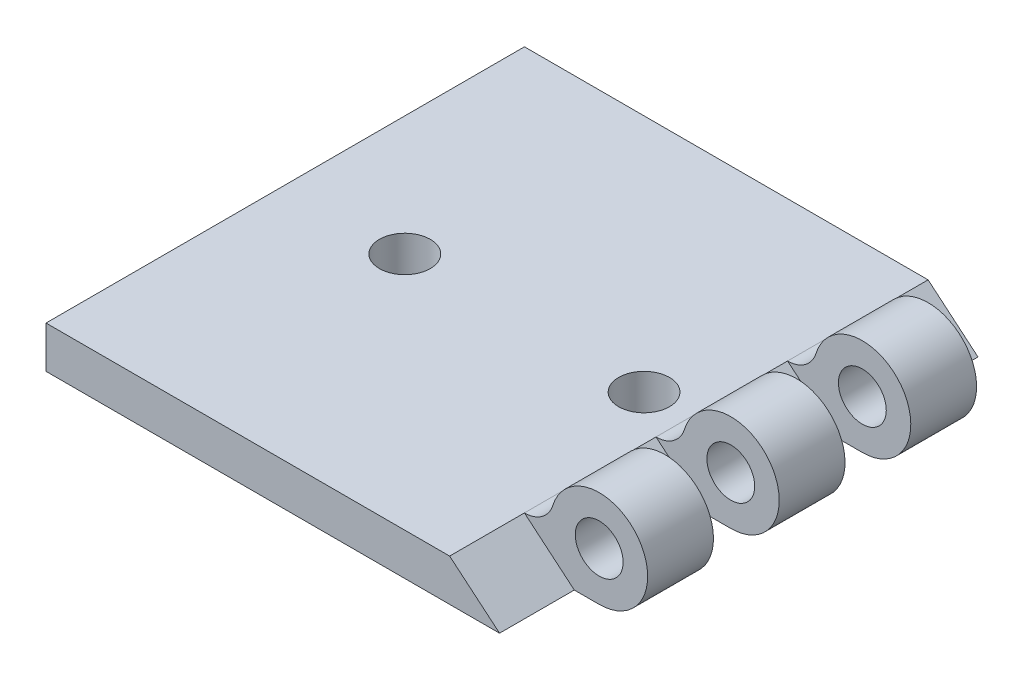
ISO-10303-21;
HEADER;
FILE_DESCRIPTION(('STEP AP214'),'2;1');
FILE_NAME('part.step','',(''),(''),'','','');
FILE_SCHEMA(('AUTOMOTIVE_DESIGN { 1 0 10303 214 1 1 1 1 }'));
ENDSEC;
DATA;
#1=APPLICATION_CONTEXT('core data for automotive mechanical design processes');
#2=APPLICATION_PROTOCOL_DEFINITION('international standard','automotive_design',2000,#1);
#3=PRODUCT_CONTEXT('',#1,'mechanical');
#4=PRODUCT('Part','Part','',(#3));
#5=PRODUCT_RELATED_PRODUCT_CATEGORY('part','',(#4));
#6=PRODUCT_DEFINITION_FORMATION('','',#4);
#7=PRODUCT_DEFINITION_CONTEXT('part definition',#1,'design');
#8=PRODUCT_DEFINITION('design','',#6,#7);
#9=PRODUCT_DEFINITION_SHAPE('','',#8);
#10=(LENGTH_UNIT() NAMED_UNIT(*) SI_UNIT(.MILLI.,.METRE.));
#11=(NAMED_UNIT(*) PLANE_ANGLE_UNIT() SI_UNIT($,.RADIAN.));
#12=(NAMED_UNIT(*) SI_UNIT($,.STERADIAN.) SOLID_ANGLE_UNIT());
#13=UNCERTAINTY_MEASURE_WITH_UNIT(LENGTH_MEASURE(1.E-05),#10,'distance_accuracy_value','');
#14=(GEOMETRIC_REPRESENTATION_CONTEXT(3) GLOBAL_UNCERTAINTY_ASSIGNED_CONTEXT((#13)) GLOBAL_UNIT_ASSIGNED_CONTEXT((#10,
#11,#12)) REPRESENTATION_CONTEXT('',''));
#15=CARTESIAN_POINT('',(0.,0.,0.));
#16=DIRECTION('',(0.,0.,1.));
#17=DIRECTION('',(1.,0.,0.));
#18=AXIS2_PLACEMENT_3D('',#15,#16,#17);
#19=CARTESIAN_POINT('',(-12.5059985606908,12.,80.));
#20=DIRECTION('',(0.,0.,-1.));
#21=DIRECTION('',(-1.,0.,0.));
#22=AXIS2_PLACEMENT_3D('',#19,#20,#21);
#23=CYLINDRICAL_SURFACE('',#22,5.);
#24=CARTESIAN_POINT('',(-12.5059985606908,12.,12.5));
#25=DIRECTION('',(0.,0.,-1.));
#26=DIRECTION('',(0.,1.,0.));
#27=AXIS2_PLACEMENT_3D('',#24,#25,#26);
#28=CIRCLE('',#27,5.);
#29=CARTESIAN_POINT('',(-12.5059985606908,6.99999999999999,12.5));
#30=VERTEX_POINT('',#29);
#31=CARTESIAN_POINT('',(-7.73271666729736,10.5114503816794,12.5));
#32=VERTEX_POINT('',#31);
#33=EDGE_CURVE('E153',#30,#32,#28,.F.);
#34=ORIENTED_EDGE('',*,*,#33,.F.);
#35=DIRECTION('',(0.,0.,-1.));
#36=VECTOR('',#35,1.);
#37=CARTESIAN_POINT('',(-12.5059985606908,6.99999999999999,80.));
#38=LINE('',#37,#36);
#39=CARTESIAN_POINT('',(-12.5059985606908,6.99999999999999,23.5));
#40=VERTEX_POINT('',#39);
#41=EDGE_CURVE('E174',#40,#30,#38,.T.);
#42=ORIENTED_EDGE('',*,*,#41,.F.);
#43=CARTESIAN_POINT('',(-12.5059985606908,12.,23.5));
#44=DIRECTION('',(0.,0.,1.));
#45=DIRECTION('',(0.,-1.,0.));
#46=AXIS2_PLACEMENT_3D('',#43,#44,#45);
#47=CIRCLE('',#46,5.);
#48=CARTESIAN_POINT('',(-7.73271666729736,10.5114503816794,23.5));
#49=VERTEX_POINT('',#48);
#50=EDGE_CURVE('E276',#49,#40,#47,.F.);
#51=ORIENTED_EDGE('',*,*,#50,.F.);
#52=DIRECTION('',(0.,0.,-1.));
#53=VECTOR('',#52,1.);
#54=CARTESIAN_POINT('',(-7.73271666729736,10.5114503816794,80.));
#55=LINE('',#54,#53);
#56=EDGE_CURVE('E177',#49,#32,#55,.T.);
#57=ORIENTED_EDGE('',*,*,#56,.T.);
#58=EDGE_LOOP('',(#34,#42,#51,#57));
#59=FACE_BOUND('',#58,.T.);
#60=ADVANCED_FACE('F34',(#59),#23,.F.);
#61=CARTESIAN_POINT('',(0.,0.,80.));
#62=DIRECTION('',(0.,1.,0.));
#63=DIRECTION('',(-1.,0.,0.));
#64=AXIS2_PLACEMENT_3D('',#61,#62,#63);
#65=PLANE('',#64);
#66=CARTESIAN_POINT('',(-20.,0.,40.));
#67=DIRECTION('',(0.,-1.,0.));
#68=DIRECTION('',(1.,0.,0.));
#69=AXIS2_PLACEMENT_3D('',#66,#67,#68);
#70=CIRCLE('',#69,4.25);
#71=CARTESIAN_POINT('',(-15.75,0.,40.));
#72=VERTEX_POINT('',#71);
#73=EDGE_CURVE('E319',#72,#72,#70,.T.);
#74=ORIENTED_EDGE('',*,*,#73,.F.);
#75=EDGE_LOOP('',(#74));
#76=FACE_BOUND('',#75,.T.);
#77=CARTESIAN_POINT('',(-60.,0.,40.));
#78=DIRECTION('',(0.,-1.,0.));
#79=DIRECTION('',(1.,0.,0.));
#80=AXIS2_PLACEMENT_3D('',#77,#78,#79);
#81=CIRCLE('',#80,4.25000000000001);
#82=CARTESIAN_POINT('',(-55.75,0.,40.));
#83=VERTEX_POINT('',#82);
#84=EDGE_CURVE('E311',#83,#83,#81,.T.);
#85=ORIENTED_EDGE('',*,*,#84,.F.);
#86=EDGE_LOOP('',(#85));
#87=FACE_BOUND('',#86,.T.);
#88=DIRECTION('',(0.,0.,-1.));
#89=VECTOR('',#88,1.);
#90=CARTESIAN_POINT('',(-4.16372341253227,0.,80.));
#91=LINE('',#90,#89);
#92=CARTESIAN_POINT('',(-4.16372341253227,0.,12.5));
#93=VERTEX_POINT('',#92);
#94=CARTESIAN_POINT('',(-4.16372341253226,0.,0.));
#95=VERTEX_POINT('',#94);
#96=EDGE_CURVE('E257',#93,#95,#91,.T.);
#97=ORIENTED_EDGE('',*,*,#96,.F.);
#98=DIRECTION('',(-1.,0.,0.));
#99=VECTOR('',#98,1.);
#100=CARTESIAN_POINT('',(0.,0.,12.5));
#101=LINE('',#100,#99);
#102=CARTESIAN_POINT('',(0.,0.,12.5));
#103=VERTEX_POINT('',#102);
#104=EDGE_CURVE('E156',#103,#93,#101,.T.);
#105=ORIENTED_EDGE('',*,*,#104,.F.);
#106=DIRECTION('',(0.,0.,-1.));
#107=VECTOR('',#106,1.);
#108=CARTESIAN_POINT('',(0.,0.,80.));
#109=LINE('',#108,#107);
#110=CARTESIAN_POINT('',(0.,0.,23.5));
#111=VERTEX_POINT('',#110);
#112=EDGE_CURVE('E239',#111,#103,#109,.T.);
#113=ORIENTED_EDGE('',*,*,#112,.F.);
#114=DIRECTION('',(1.,0.,0.));
#115=VECTOR('',#114,1.);
#116=CARTESIAN_POINT('',(0.,0.,23.5));
#117=LINE('',#116,#115);
#118=CARTESIAN_POINT('',(-4.16372341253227,0.,23.5));
#119=VERTEX_POINT('',#118);
#120=EDGE_CURVE('E274',#119,#111,#117,.T.);
#121=ORIENTED_EDGE('',*,*,#120,.F.);
#122=DIRECTION('',(0.,0.,-1.));
#123=VECTOR('',#122,1.);
#124=CARTESIAN_POINT('',(-4.16372341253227,0.,80.));
#125=LINE('',#124,#123);
#126=CARTESIAN_POINT('',(-4.16372341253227,0.,34.5));
#127=VERTEX_POINT('',#126);
#128=EDGE_CURVE('E269',#127,#119,#125,.T.);
#129=ORIENTED_EDGE('',*,*,#128,.F.);
#130=DIRECTION('',(-1.,0.,0.));
#131=VECTOR('',#130,1.);
#132=CARTESIAN_POINT('',(0.,0.,34.5));
#133=LINE('',#132,#131);
#134=CARTESIAN_POINT('',(0.,0.,34.5));
#135=VERTEX_POINT('',#134);
#136=EDGE_CURVE('E281',#135,#127,#133,.T.);
#137=ORIENTED_EDGE('',*,*,#136,.F.);
#138=CARTESIAN_POINT('',(0.,0.,45.5));
#139=VERTEX_POINT('',#138);
#140=EDGE_CURVE('E244',#139,#135,#109,.T.);
#141=ORIENTED_EDGE('',*,*,#140,.F.);
#142=DIRECTION('',(1.,0.,0.));
#143=VECTOR('',#142,1.);
#144=CARTESIAN_POINT('',(0.,0.,45.5));
#145=LINE('',#144,#143);
#146=CARTESIAN_POINT('',(-4.16372341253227,0.,45.5));
#147=VERTEX_POINT('',#146);
#148=EDGE_CURVE('E294',#147,#139,#145,.T.);
#149=ORIENTED_EDGE('',*,*,#148,.F.);
#150=DIRECTION('',(0.,0.,-1.));
#151=VECTOR('',#150,1.);
#152=CARTESIAN_POINT('',(-4.16372341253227,0.,80.));
#153=LINE('',#152,#151);
#154=CARTESIAN_POINT('',(-4.16372341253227,0.,56.5));
#155=VERTEX_POINT('',#154);
#156=EDGE_CURVE('E289',#155,#147,#153,.T.);
#157=ORIENTED_EDGE('',*,*,#156,.F.);
#158=DIRECTION('',(-1.,0.,0.));
#159=VECTOR('',#158,1.);
#160=CARTESIAN_POINT('',(0.,0.,56.5));
#161=LINE('',#160,#159);
#162=CARTESIAN_POINT('',(0.,0.,56.5));
#163=VERTEX_POINT('',#162);
#164=EDGE_CURVE('E207',#163,#155,#161,.T.);
#165=ORIENTED_EDGE('',*,*,#164,.F.);
#166=CARTESIAN_POINT('',(0.,0.,67.5));
#167=VERTEX_POINT('',#166);
#168=EDGE_CURVE('E241',#167,#163,#109,.T.);
#169=ORIENTED_EDGE('',*,*,#168,.F.);
#170=DIRECTION('',(1.,0.,0.));
#171=VECTOR('',#170,1.);
#172=CARTESIAN_POINT('',(0.,0.,67.5));
#173=LINE('',#172,#171);
#174=CARTESIAN_POINT('',(-4.16372341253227,0.,67.5));
#175=VERTEX_POINT('',#174);
#176=EDGE_CURVE('E221',#175,#167,#173,.T.);
#177=ORIENTED_EDGE('',*,*,#176,.F.);
#178=DIRECTION('',(0.,0.,-1.));
#179=VECTOR('',#178,1.);
#180=CARTESIAN_POINT('',(-4.16372341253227,0.,80.));
#181=LINE('',#180,#179);
#182=CARTESIAN_POINT('',(-4.16372341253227,0.,80.));
#183=VERTEX_POINT('',#182);
#184=EDGE_CURVE('E11',#183,#175,#181,.T.);
#185=ORIENTED_EDGE('',*,*,#184,.F.);
#186=DIRECTION('',(1.,0.,0.));
#187=VECTOR('',#186,1.);
#188=CARTESIAN_POINT('',(0.,0.,80.));
#189=LINE('',#188,#187);
#190=CARTESIAN_POINT('',(-80.,0.,80.));
#191=VERTEX_POINT('',#190);
#192=EDGE_CURVE('E230',#191,#183,#189,.T.);
#193=ORIENTED_EDGE('',*,*,#192,.F.);
#194=DIRECTION('',(0.,0.,-1.));
#195=VECTOR('',#194,1.);
#196=CARTESIAN_POINT('',(-80.,0.,80.));
#197=LINE('',#196,#195);
#198=CARTESIAN_POINT('',(-80.,0.,0.));
#199=VERTEX_POINT('',#198);
#200=EDGE_CURVE('E187',#191,#199,#197,.T.);
#201=ORIENTED_EDGE('',*,*,#200,.T.);
#202=DIRECTION('',(1.,0.,0.));
#203=VECTOR('',#202,1.);
#204=CARTESIAN_POINT('',(0.,0.,0.));
#205=LINE('',#204,#203);
#206=EDGE_CURVE('E228',#199,#95,#205,.T.);
#207=ORIENTED_EDGE('',*,*,#206,.T.);
#208=EDGE_LOOP('',(#97,#105,#113,#121,#129,#137,#141,#149,#157,#165,#169,#177,#185,#193,#201,#207));
#209=FACE_BOUND('',#208,.T.);
#210=ADVANCED_FACE('F250',(#76,#87,#209),#65,.F.);
#211=CARTESIAN_POINT('',(0.,8.1,80.));
#212=DIRECTION('',(0.,0.,-1.));
#213=DIRECTION('',(-1.,0.,0.));
#214=AXIS2_PLACEMENT_3D('',#211,#212,#213);
#215=CYLINDRICAL_SURFACE('',#214,8.1);
#216=CARTESIAN_POINT('',(0.,8.1,12.5));
#217=DIRECTION('',(0.,0.,-1.));
#218=DIRECTION('',(0.,1.,0.));
#219=AXIS2_PLACEMENT_3D('',#216,#217,#218);
#220=CIRCLE('',#219,8.1);
#221=EDGE_CURVE('E262',#32,#103,#220,.T.);
#222=ORIENTED_EDGE('',*,*,#221,.F.);
#223=ORIENTED_EDGE('',*,*,#56,.F.);
#224=CARTESIAN_POINT('',(0.,8.1,23.5));
#225=DIRECTION('',(0.,0.,1.));
#226=DIRECTION('',(0.,-1.,0.));
#227=AXIS2_PLACEMENT_3D('',#224,#225,#226);
#228=CIRCLE('',#227,8.1);
#229=EDGE_CURVE('E272',#111,#49,#228,.T.);
#230=ORIENTED_EDGE('',*,*,#229,.F.);
#231=ORIENTED_EDGE('',*,*,#112,.T.);
#232=EDGE_LOOP('',(#222,#223,#230,#231));
#233=FACE_BOUND('',#232,.T.);
#234=ADVANCED_FACE('F329',(#233),#215,.T.);
#235=CARTESIAN_POINT('',(0.,8.1,80.));
#236=DIRECTION('',(0.,0.,-1.));
#237=DIRECTION('',(-1.,0.,0.));
#238=AXIS2_PLACEMENT_3D('',#235,#236,#237);
#239=CYLINDRICAL_SURFACE('',#238,4.);
#240=CARTESIAN_POINT('',(0.,8.1,23.5));
#241=DIRECTION('',(0.,0.,1.));
#242=DIRECTION('',(0.,-1.,0.));
#243=AXIS2_PLACEMENT_3D('',#240,#241,#242);
#244=CIRCLE('',#243,4.);
#245=CARTESIAN_POINT('',(0.,4.1,23.5));
#246=VERTEX_POINT('',#245);
#247=EDGE_CURVE('E271',#246,#246,#244,.T.);
#248=ORIENTED_EDGE('',*,*,#247,.T.);
#249=EDGE_LOOP('',(#248));
#250=FACE_BOUND('',#249,.T.);
#251=CARTESIAN_POINT('',(0.,8.1,12.5));
#252=DIRECTION('',(0.,0.,-1.));
#253=DIRECTION('',(0.,1.,0.));
#254=AXIS2_PLACEMENT_3D('',#251,#252,#253);
#255=CIRCLE('',#254,4.);
#256=CARTESIAN_POINT('',(0.,12.1,12.5));
#257=VERTEX_POINT('',#256);
#258=EDGE_CURVE('E259',#257,#257,#255,.T.);
#259=ORIENTED_EDGE('',*,*,#258,.T.);
#260=EDGE_LOOP('',(#259));
#261=FACE_BOUND('',#260,.T.);
#262=ADVANCED_FACE('F335',(#250,#261),#239,.F.);
#263=CARTESIAN_POINT('',(-12.5059985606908,12.,0.));
#264=DIRECTION('',(0.,0.,-1.));
#265=DIRECTION('',(-1.,0.,0.));
#266=AXIS2_PLACEMENT_3D('',#263,#264,#265);
#267=PLANE('',#266);
#268=DIRECTION('',(-1.,0.,0.));
#269=VECTOR('',#268,1.);
#270=CARTESIAN_POINT('',(-80.,6.99999999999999,0.));
#271=LINE('',#270,#269);
#272=CARTESIAN_POINT('',(-12.5059985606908,6.99999999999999,0.));
#273=VERTEX_POINT('',#272);
#274=CARTESIAN_POINT('',(-80.,6.99999999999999,0.));
#275=VERTEX_POINT('',#274);
#276=EDGE_CURVE('E224',#273,#275,#271,.T.);
#277=ORIENTED_EDGE('',*,*,#276,.F.);
#278=DIRECTION('',(-0.766044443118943,0.642787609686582,0.));
#279=VECTOR('',#278,1.);
#280=CARTESIAN_POINT('',(3.03292490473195,-6.03870494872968,0.));
#281=LINE('',#280,#279);
#282=EDGE_CURVE('E159',#95,#273,#281,.T.);
#283=ORIENTED_EDGE('',*,*,#282,.F.);
#284=ORIENTED_EDGE('',*,*,#206,.F.);
#285=DIRECTION('',(0.,-1.,0.));
#286=VECTOR('',#285,1.);
#287=CARTESIAN_POINT('',(-80.,0.,0.));
#288=LINE('',#287,#286);
#289=EDGE_CURVE('E234',#275,#199,#288,.T.);
#290=ORIENTED_EDGE('',*,*,#289,.F.);
#291=EDGE_LOOP('',(#277,#283,#284,#290));
#292=FACE_BOUND('',#291,.T.);
#293=ADVANCED_FACE('F256',(#292),#267,.T.);
#294=CARTESIAN_POINT('',(-12.5059985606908,12.,34.5));
#295=DIRECTION('',(0.,0.,-1.));
#296=DIRECTION('',(0.,1.,0.));
#297=AXIS2_PLACEMENT_3D('',#294,#295,#296);
#298=CIRCLE('',#297,5.);
#299=CARTESIAN_POINT('',(-12.5059985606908,6.99999999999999,34.5));
#300=VERTEX_POINT('',#299);
#301=CARTESIAN_POINT('',(-7.73271666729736,10.5114503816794,34.5));
#302=VERTEX_POINT('',#301);
#303=EDGE_CURVE('E283',#300,#302,#298,.F.);
#304=ORIENTED_EDGE('',*,*,#303,.F.);
#305=CARTESIAN_POINT('',(-12.5059985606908,6.99999999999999,45.5));
#306=VERTEX_POINT('',#305);
#307=EDGE_CURVE('E182',#306,#300,#38,.T.);
#308=ORIENTED_EDGE('',*,*,#307,.F.);
#309=CARTESIAN_POINT('',(-12.5059985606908,12.,45.5));
#310=DIRECTION('',(0.,0.,1.));
#311=DIRECTION('',(0.,-1.,0.));
#312=AXIS2_PLACEMENT_3D('',#309,#310,#311);
#313=CIRCLE('',#312,5.);
#314=CARTESIAN_POINT('',(-7.73271666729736,10.5114503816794,45.5));
#315=VERTEX_POINT('',#314);
#316=EDGE_CURVE('E296',#315,#306,#313,.F.);
#317=ORIENTED_EDGE('',*,*,#316,.F.);
#318=EDGE_CURVE('E240',#315,#302,#55,.T.);
#319=ORIENTED_EDGE('',*,*,#318,.T.);
#320=EDGE_LOOP('',(#304,#308,#317,#319));
#321=FACE_BOUND('',#320,.T.);
#322=ADVANCED_FACE('F340',(#321),#23,.F.);
#323=CARTESIAN_POINT('',(0.,8.1,34.5));
#324=DIRECTION('',(0.,0.,-1.));
#325=DIRECTION('',(0.,1.,0.));
#326=AXIS2_PLACEMENT_3D('',#323,#324,#325);
#327=CIRCLE('',#326,8.1);
#328=EDGE_CURVE('E279',#302,#135,#327,.T.);
#329=ORIENTED_EDGE('',*,*,#328,.F.);
#330=ORIENTED_EDGE('',*,*,#318,.F.);
#331=CARTESIAN_POINT('',(0.,8.1,45.5));
#332=DIRECTION('',(0.,0.,1.));
#333=DIRECTION('',(0.,-1.,0.));
#334=AXIS2_PLACEMENT_3D('',#331,#332,#333);
#335=CIRCLE('',#334,8.1);
#336=EDGE_CURVE('E292',#139,#315,#335,.T.);
#337=ORIENTED_EDGE('',*,*,#336,.F.);
#338=ORIENTED_EDGE('',*,*,#140,.T.);
#339=EDGE_LOOP('',(#329,#330,#337,#338));
#340=FACE_BOUND('',#339,.T.);
#341=ADVANCED_FACE('F338',(#340),#215,.T.);
#342=CARTESIAN_POINT('',(0.,8.1,45.5));
#343=DIRECTION('',(0.,0.,1.));
#344=DIRECTION('',(0.,-1.,0.));
#345=AXIS2_PLACEMENT_3D('',#342,#343,#344);
#346=CIRCLE('',#345,4.);
#347=CARTESIAN_POINT('',(0.,4.1,45.5));
#348=VERTEX_POINT('',#347);
#349=EDGE_CURVE('E291',#348,#348,#346,.T.);
#350=ORIENTED_EDGE('',*,*,#349,.T.);
#351=EDGE_LOOP('',(#350));
#352=FACE_BOUND('',#351,.T.);
#353=CARTESIAN_POINT('',(0.,8.1,34.5));
#354=DIRECTION('',(0.,0.,-1.));
#355=DIRECTION('',(0.,1.,0.));
#356=AXIS2_PLACEMENT_3D('',#353,#354,#355);
#357=CIRCLE('',#356,4.);
#358=CARTESIAN_POINT('',(0.,12.1,34.5));
#359=VERTEX_POINT('',#358);
#360=EDGE_CURVE('E278',#359,#359,#357,.T.);
#361=ORIENTED_EDGE('',*,*,#360,.T.);
#362=EDGE_LOOP('',(#361));
#363=FACE_BOUND('',#362,.T.);
#364=ADVANCED_FACE('F400',(#352,#363),#239,.F.);
#365=CARTESIAN_POINT('',(-12.5059985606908,12.,56.5));
#366=DIRECTION('',(0.,0.,-1.));
#367=DIRECTION('',(0.,1.,0.));
#368=AXIS2_PLACEMENT_3D('',#365,#366,#367);
#369=CIRCLE('',#368,5.);
#370=CARTESIAN_POINT('',(-12.5059985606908,6.99999999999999,56.5));
#371=VERTEX_POINT('',#370);
#372=CARTESIAN_POINT('',(-7.73271666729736,10.5114503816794,56.5));
#373=VERTEX_POINT('',#372);
#374=EDGE_CURVE('E202',#371,#373,#369,.F.);
#375=ORIENTED_EDGE('',*,*,#374,.F.);
#376=CARTESIAN_POINT('',(-12.5059985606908,6.99999999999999,67.5));
#377=VERTEX_POINT('',#376);
#378=EDGE_CURVE('E185',#377,#371,#38,.T.);
#379=ORIENTED_EDGE('',*,*,#378,.F.);
#380=CARTESIAN_POINT('',(-12.5059985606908,12.,67.5));
#381=DIRECTION('',(0.,0.,1.));
#382=DIRECTION('',(1.,0.,0.));
#383=AXIS2_PLACEMENT_3D('',#380,#381,#382);
#384=CIRCLE('',#383,5.);
#385=CARTESIAN_POINT('',(-7.73271666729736,10.5114503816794,67.5));
#386=VERTEX_POINT('',#385);
#387=EDGE_CURVE('E200',#386,#377,#384,.F.);
#388=ORIENTED_EDGE('',*,*,#387,.F.);
#389=EDGE_CURVE('E203',#386,#373,#55,.T.);
#390=ORIENTED_EDGE('',*,*,#389,.T.);
#391=EDGE_LOOP('',(#375,#379,#388,#390));
#392=FACE_BOUND('',#391,.T.);
#393=ADVANCED_FACE('F36',(#392),#23,.F.);
#394=CARTESIAN_POINT('',(0.,8.1,56.5));
#395=DIRECTION('',(0.,0.,-1.));
#396=DIRECTION('',(0.,1.,0.));
#397=AXIS2_PLACEMENT_3D('',#394,#395,#396);
#398=CIRCLE('',#397,8.1);
#399=EDGE_CURVE('E212',#373,#163,#398,.T.);
#400=ORIENTED_EDGE('',*,*,#399,.F.);
#401=ORIENTED_EDGE('',*,*,#389,.F.);
#402=CARTESIAN_POINT('',(0.,8.1,67.5));
#403=DIRECTION('',(0.,0.,1.));
#404=DIRECTION('',(1.,0.,0.));
#405=AXIS2_PLACEMENT_3D('',#402,#403,#404);
#406=CIRCLE('',#405,8.1);
#407=EDGE_CURVE('E219',#167,#386,#406,.T.);
#408=ORIENTED_EDGE('',*,*,#407,.F.);
#409=ORIENTED_EDGE('',*,*,#168,.T.);
#410=EDGE_LOOP('',(#400,#401,#408,#409));
#411=FACE_BOUND('',#410,.T.);
#412=ADVANCED_FACE('F339',(#411),#215,.T.);
#413=CARTESIAN_POINT('',(0.,8.1,67.5));
#414=DIRECTION('',(0.,0.,1.));
#415=DIRECTION('',(1.,0.,0.));
#416=AXIS2_PLACEMENT_3D('',#413,#414,#415);
#417=CIRCLE('',#416,4.);
#418=CARTESIAN_POINT('',(4.,8.1,67.5));
#419=VERTEX_POINT('',#418);
#420=EDGE_CURVE('E218',#419,#419,#417,.T.);
#421=ORIENTED_EDGE('',*,*,#420,.T.);
#422=EDGE_LOOP('',(#421));
#423=FACE_BOUND('',#422,.T.);
#424=CARTESIAN_POINT('',(0.,8.1,56.5));
#425=DIRECTION('',(0.,0.,-1.));
#426=DIRECTION('',(0.,1.,0.));
#427=AXIS2_PLACEMENT_3D('',#424,#425,#426);
#428=CIRCLE('',#427,4.);
#429=CARTESIAN_POINT('',(0.,12.1,56.5));
#430=VERTEX_POINT('',#429);
#431=EDGE_CURVE('E297',#430,#430,#428,.T.);
#432=ORIENTED_EDGE('',*,*,#431,.T.);
#433=EDGE_LOOP('',(#432));
#434=FACE_BOUND('',#433,.T.);
#435=ADVANCED_FACE('F352',(#423,#434),#239,.F.);
#436=CARTESIAN_POINT('',(-12.5059985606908,12.,80.));
#437=DIRECTION('',(0.,0.,-1.));
#438=DIRECTION('',(-1.,0.,0.));
#439=AXIS2_PLACEMENT_3D('',#436,#437,#438);
#440=PLANE('',#439);
#441=DIRECTION('',(-0.766044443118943,0.642787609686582,0.));
#442=VECTOR('',#441,1.);
#443=CARTESIAN_POINT('',(3.03292490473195,-6.03870494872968,80.));
#444=LINE('',#443,#442);
#445=CARTESIAN_POINT('',(-12.5059985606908,6.99999999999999,80.));
#446=VERTEX_POINT('',#445);
#447=EDGE_CURVE('E210',#183,#446,#444,.T.);
#448=ORIENTED_EDGE('',*,*,#447,.T.);
#449=DIRECTION('',(-1.,0.,0.));
#450=VECTOR('',#449,1.);
#451=CARTESIAN_POINT('',(-80.,6.99999999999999,80.));
#452=LINE('',#451,#450);
#453=CARTESIAN_POINT('',(-80.,6.99999999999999,80.));
#454=VERTEX_POINT('',#453);
#455=EDGE_CURVE('E225',#446,#454,#452,.T.);
#456=ORIENTED_EDGE('',*,*,#455,.T.);
#457=DIRECTION('',(0.,-1.,0.));
#458=VECTOR('',#457,1.);
#459=CARTESIAN_POINT('',(-80.,0.,80.));
#460=LINE('',#459,#458);
#461=EDGE_CURVE('E227',#454,#191,#460,.T.);
#462=ORIENTED_EDGE('',*,*,#461,.T.);
#463=ORIENTED_EDGE('',*,*,#192,.T.);
#464=EDGE_LOOP('',(#448,#456,#462,#463));
#465=FACE_BOUND('',#464,.T.);
#466=ADVANCED_FACE('F347',(#465),#440,.F.);
#467=CARTESIAN_POINT('',(-80.,6.99999999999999,80.));
#468=DIRECTION('',(0.,-1.,0.));
#469=DIRECTION('',(1.,0.,0.));
#470=AXIS2_PLACEMENT_3D('',#467,#468,#469);
#471=PLANE('',#470);
#472=CARTESIAN_POINT('',(-20.,6.99999999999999,40.));
#473=DIRECTION('',(0.,-1.,0.));
#474=DIRECTION('',(1.,0.,0.));
#475=AXIS2_PLACEMENT_3D('',#472,#473,#474);
#476=CIRCLE('',#475,4.25);
#477=CARTESIAN_POINT('',(-15.75,6.99999999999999,40.));
#478=VERTEX_POINT('',#477);
#479=EDGE_CURVE('E38',#478,#478,#476,.T.);
#480=ORIENTED_EDGE('',*,*,#479,.T.);
#481=EDGE_LOOP('',(#480));
#482=FACE_BOUND('',#481,.T.);
#483=CARTESIAN_POINT('',(-60.,6.99999999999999,40.));
#484=DIRECTION('',(0.,-1.,0.));
#485=DIRECTION('',(1.,0.,0.));
#486=AXIS2_PLACEMENT_3D('',#483,#484,#485);
#487=CIRCLE('',#486,4.25000000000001);
#488=CARTESIAN_POINT('',(-55.75,6.99999999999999,40.));
#489=VERTEX_POINT('',#488);
#490=EDGE_CURVE('E168',#489,#489,#487,.T.);
#491=ORIENTED_EDGE('',*,*,#490,.T.);
#492=EDGE_LOOP('',(#491));
#493=FACE_BOUND('',#492,.T.);
#494=ORIENTED_EDGE('',*,*,#276,.T.);
#495=DIRECTION('',(0.,0.,-1.));
#496=VECTOR('',#495,1.);
#497=CARTESIAN_POINT('',(-80.,6.99999999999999,80.));
#498=LINE('',#497,#496);
#499=EDGE_CURVE('E183',#454,#275,#498,.T.);
#500=ORIENTED_EDGE('',*,*,#499,.F.);
#501=ORIENTED_EDGE('',*,*,#455,.F.);
#502=EDGE_CURVE('E43',#446,#377,#38,.T.);
#503=ORIENTED_EDGE('',*,*,#502,.T.);
#504=ORIENTED_EDGE('',*,*,#378,.T.);
#505=DIRECTION('',(0.,0.,-1.));
#506=VECTOR('',#505,1.);
#507=CARTESIAN_POINT('',(-12.5059985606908,6.99999999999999,45.5));
#508=LINE('',#507,#506);
#509=EDGE_CURVE('E195',#371,#306,#508,.T.);
#510=ORIENTED_EDGE('',*,*,#509,.T.);
#511=ORIENTED_EDGE('',*,*,#307,.T.);
#512=DIRECTION('',(0.,0.,-1.));
#513=VECTOR('',#512,1.);
#514=CARTESIAN_POINT('',(-12.5059985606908,6.99999999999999,23.5));
#515=LINE('',#514,#513);
#516=EDGE_CURVE('E178',#300,#40,#515,.T.);
#517=ORIENTED_EDGE('',*,*,#516,.T.);
#518=ORIENTED_EDGE('',*,*,#41,.T.);
#519=DIRECTION('',(0.,0.,-1.));
#520=VECTOR('',#519,1.);
#521=CARTESIAN_POINT('',(-12.5059985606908,6.99999999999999,0.));
#522=LINE('',#521,#520);
#523=EDGE_CURVE('E160',#30,#273,#522,.T.);
#524=ORIENTED_EDGE('',*,*,#523,.T.);
#525=EDGE_LOOP('',(#494,#500,#501,#503,#504,#510,#511,#517,#518,#524));
#526=FACE_BOUND('',#525,.T.);
#527=ADVANCED_FACE('F180',(#482,#493,#526),#471,.F.);
#528=CARTESIAN_POINT('',(-80.,0.,80.));
#529=DIRECTION('',(1.,0.,0.));
#530=DIRECTION('',(0.,0.,-1.));
#531=AXIS2_PLACEMENT_3D('',#528,#529,#530);
#532=PLANE('',#531);
#533=ORIENTED_EDGE('',*,*,#289,.T.);
#534=ORIENTED_EDGE('',*,*,#200,.F.);
#535=ORIENTED_EDGE('',*,*,#461,.F.);
#536=ORIENTED_EDGE('',*,*,#499,.T.);
#537=EDGE_LOOP('',(#533,#534,#535,#536));
#538=FACE_BOUND('',#537,.T.);
#539=ADVANCED_FACE('F343',(#538),#532,.F.);
#540=CARTESIAN_POINT('',(3.03292490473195,-6.03870494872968,67.5));
#541=DIRECTION('',(0.642787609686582,0.766044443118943,0.));
#542=DIRECTION('',(-0.766044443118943,0.642787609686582,0.));
#543=AXIS2_PLACEMENT_3D('',#540,#541,#542);
#544=PLANE('',#543);
#545=ORIENTED_EDGE('',*,*,#184,.T.);
#546=DIRECTION('',(-0.766044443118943,0.642787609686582,0.));
#547=VECTOR('',#546,1.);
#548=CARTESIAN_POINT('',(3.03292490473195,-6.03870494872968,67.5));
#549=LINE('',#548,#547);
#550=EDGE_CURVE('E206',#175,#377,#549,.T.);
#551=ORIENTED_EDGE('',*,*,#550,.T.);
#552=ORIENTED_EDGE('',*,*,#502,.F.);
#553=ORIENTED_EDGE('',*,*,#447,.F.);
#554=EDGE_LOOP('',(#545,#551,#552,#553));
#555=FACE_BOUND('',#554,.T.);
#556=ADVANCED_FACE('F345',(#555),#544,.T.);
#557=CARTESIAN_POINT('',(3.03292490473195,-6.03870494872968,67.5));
#558=DIRECTION('',(0.,0.,1.));
#559=DIRECTION('',(1.,0.,0.));
#560=AXIS2_PLACEMENT_3D('',#557,#558,#559);
#561=PLANE('',#560);
#562=ORIENTED_EDGE('',*,*,#420,.F.);
#563=EDGE_LOOP('',(#562));
#564=FACE_BOUND('',#563,.T.);
#565=ORIENTED_EDGE('',*,*,#387,.T.);
#566=ORIENTED_EDGE('',*,*,#550,.F.);
#567=ORIENTED_EDGE('',*,*,#176,.T.);
#568=ORIENTED_EDGE('',*,*,#407,.T.);
#569=EDGE_LOOP('',(#565,#566,#567,#568));
#570=FACE_BOUND('',#569,.T.);
#571=ADVANCED_FACE('F390',(#564,#570),#561,.T.);
#572=CARTESIAN_POINT('',(3.03292490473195,-6.03870494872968,56.5));
#573=DIRECTION('',(0.,0.,-1.));
#574=DIRECTION('',(0.,1.,0.));
#575=AXIS2_PLACEMENT_3D('',#572,#573,#574);
#576=PLANE('',#575);
#577=ORIENTED_EDGE('',*,*,#431,.F.);
#578=EDGE_LOOP('',(#577));
#579=FACE_BOUND('',#578,.T.);
#580=ORIENTED_EDGE('',*,*,#374,.T.);
#581=ORIENTED_EDGE('',*,*,#399,.T.);
#582=ORIENTED_EDGE('',*,*,#164,.T.);
#583=DIRECTION('',(-0.766044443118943,0.642787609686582,0.));
#584=VECTOR('',#583,1.);
#585=CARTESIAN_POINT('',(3.03292490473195,-6.03870494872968,56.5));
#586=LINE('',#585,#584);
#587=EDGE_CURVE('E287',#155,#371,#586,.T.);
#588=ORIENTED_EDGE('',*,*,#587,.T.);
#589=EDGE_LOOP('',(#580,#581,#582,#588));
#590=FACE_BOUND('',#589,.T.);
#591=ADVANCED_FACE('F384',(#579,#590),#576,.T.);
#592=CARTESIAN_POINT('',(3.03292490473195,-6.03870494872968,45.5));
#593=DIRECTION('',(0.,0.,1.));
#594=DIRECTION('',(0.,-1.,0.));
#595=AXIS2_PLACEMENT_3D('',#592,#593,#594);
#596=PLANE('',#595);
#597=ORIENTED_EDGE('',*,*,#349,.F.);
#598=EDGE_LOOP('',(#597));
#599=FACE_BOUND('',#598,.T.);
#600=ORIENTED_EDGE('',*,*,#316,.T.);
#601=DIRECTION('',(-0.766044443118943,0.642787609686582,0.));
#602=VECTOR('',#601,1.);
#603=CARTESIAN_POINT('',(3.03292490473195,-6.03870494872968,45.5));
#604=LINE('',#603,#602);
#605=EDGE_CURVE('E59',#147,#306,#604,.T.);
#606=ORIENTED_EDGE('',*,*,#605,.F.);
#607=ORIENTED_EDGE('',*,*,#148,.T.);
#608=ORIENTED_EDGE('',*,*,#336,.T.);
#609=EDGE_LOOP('',(#600,#606,#607,#608));
#610=FACE_BOUND('',#609,.T.);
#611=ADVANCED_FACE('F381',(#599,#610),#596,.T.);
#612=CARTESIAN_POINT('',(3.03292490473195,-6.03870494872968,45.5));
#613=DIRECTION('',(0.642787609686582,0.766044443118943,0.));
#614=DIRECTION('',(-0.766044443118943,0.642787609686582,0.));
#615=AXIS2_PLACEMENT_3D('',#612,#613,#614);
#616=PLANE('',#615);
#617=ORIENTED_EDGE('',*,*,#156,.T.);
#618=ORIENTED_EDGE('',*,*,#605,.T.);
#619=ORIENTED_EDGE('',*,*,#509,.F.);
#620=ORIENTED_EDGE('',*,*,#587,.F.);
#621=EDGE_LOOP('',(#617,#618,#619,#620));
#622=FACE_BOUND('',#621,.T.);
#623=ADVANCED_FACE('F379',(#622),#616,.T.);
#624=CARTESIAN_POINT('',(3.03292490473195,-6.03870494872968,34.5));
#625=DIRECTION('',(0.,0.,-1.));
#626=DIRECTION('',(0.,1.,0.));
#627=AXIS2_PLACEMENT_3D('',#624,#625,#626);
#628=PLANE('',#627);
#629=ORIENTED_EDGE('',*,*,#360,.F.);
#630=EDGE_LOOP('',(#629));
#631=FACE_BOUND('',#630,.T.);
#632=ORIENTED_EDGE('',*,*,#303,.T.);
#633=ORIENTED_EDGE('',*,*,#328,.T.);
#634=ORIENTED_EDGE('',*,*,#136,.T.);
#635=DIRECTION('',(-0.766044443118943,0.642787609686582,0.));
#636=VECTOR('',#635,1.);
#637=CARTESIAN_POINT('',(3.03292490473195,-6.03870494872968,34.5));
#638=LINE('',#637,#636);
#639=EDGE_CURVE('E267',#127,#300,#638,.T.);
#640=ORIENTED_EDGE('',*,*,#639,.T.);
#641=EDGE_LOOP('',(#632,#633,#634,#640));
#642=FACE_BOUND('',#641,.T.);
#643=ADVANCED_FACE('F373',(#631,#642),#628,.T.);
#644=CARTESIAN_POINT('',(3.03292490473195,-6.03870494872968,23.5));
#645=DIRECTION('',(0.,0.,1.));
#646=DIRECTION('',(0.,-1.,0.));
#647=AXIS2_PLACEMENT_3D('',#644,#645,#646);
#648=PLANE('',#647);
#649=ORIENTED_EDGE('',*,*,#247,.F.);
#650=EDGE_LOOP('',(#649));
#651=FACE_BOUND('',#650,.T.);
#652=ORIENTED_EDGE('',*,*,#50,.T.);
#653=DIRECTION('',(-0.766044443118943,0.642787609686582,0.));
#654=VECTOR('',#653,1.);
#655=CARTESIAN_POINT('',(3.03292490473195,-6.03870494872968,23.5));
#656=LINE('',#655,#654);
#657=EDGE_CURVE('E51',#119,#40,#656,.T.);
#658=ORIENTED_EDGE('',*,*,#657,.F.);
#659=ORIENTED_EDGE('',*,*,#120,.T.);
#660=ORIENTED_EDGE('',*,*,#229,.T.);
#661=EDGE_LOOP('',(#652,#658,#659,#660));
#662=FACE_BOUND('',#661,.T.);
#663=ADVANCED_FACE('F370',(#651,#662),#648,.T.);
#664=CARTESIAN_POINT('',(3.03292490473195,-6.03870494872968,23.5));
#665=DIRECTION('',(0.642787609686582,0.766044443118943,0.));
#666=DIRECTION('',(-0.766044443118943,0.642787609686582,0.));
#667=AXIS2_PLACEMENT_3D('',#664,#665,#666);
#668=PLANE('',#667);
#669=ORIENTED_EDGE('',*,*,#128,.T.);
#670=ORIENTED_EDGE('',*,*,#657,.T.);
#671=ORIENTED_EDGE('',*,*,#516,.F.);
#672=ORIENTED_EDGE('',*,*,#639,.F.);
#673=EDGE_LOOP('',(#669,#670,#671,#672));
#674=FACE_BOUND('',#673,.T.);
#675=ADVANCED_FACE('F366',(#674),#668,.T.);
#676=CARTESIAN_POINT('',(3.03292490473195,-6.03870494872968,12.5));
#677=DIRECTION('',(0.,0.,-1.));
#678=DIRECTION('',(0.,1.,0.));
#679=AXIS2_PLACEMENT_3D('',#676,#677,#678);
#680=PLANE('',#679);
#681=ORIENTED_EDGE('',*,*,#258,.F.);
#682=EDGE_LOOP('',(#681));
#683=FACE_BOUND('',#682,.T.);
#684=ORIENTED_EDGE('',*,*,#33,.T.);
#685=ORIENTED_EDGE('',*,*,#221,.T.);
#686=ORIENTED_EDGE('',*,*,#104,.T.);
#687=DIRECTION('',(-0.766044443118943,0.642787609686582,0.));
#688=VECTOR('',#687,1.);
#689=CARTESIAN_POINT('',(3.03292490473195,-6.03870494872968,12.5));
#690=LINE('',#689,#688);
#691=EDGE_CURVE('E149',#93,#30,#690,.T.);
#692=ORIENTED_EDGE('',*,*,#691,.T.);
#693=EDGE_LOOP('',(#684,#685,#686,#692));
#694=FACE_BOUND('',#693,.T.);
#695=ADVANCED_FACE('F151',(#683,#694),#680,.T.);
#696=CARTESIAN_POINT('',(3.03292490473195,-6.03870494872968,0.));
#697=DIRECTION('',(0.642787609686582,0.766044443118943,0.));
#698=DIRECTION('',(-0.766044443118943,0.642787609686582,0.));
#699=AXIS2_PLACEMENT_3D('',#696,#697,#698);
#700=PLANE('',#699);
#701=ORIENTED_EDGE('',*,*,#96,.T.);
#702=ORIENTED_EDGE('',*,*,#282,.T.);
#703=ORIENTED_EDGE('',*,*,#523,.F.);
#704=ORIENTED_EDGE('',*,*,#691,.F.);
#705=EDGE_LOOP('',(#701,#702,#703,#704));
#706=FACE_BOUND('',#705,.T.);
#707=ADVANCED_FACE('F163',(#706),#700,.T.);
#708=CARTESIAN_POINT('',(-60.,16.2,40.));
#709=DIRECTION('',(0.,-1.,0.));
#710=DIRECTION('',(1.,0.,0.));
#711=AXIS2_PLACEMENT_3D('',#708,#709,#710);
#712=CYLINDRICAL_SURFACE('',#711,4.25000000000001);
#713=ORIENTED_EDGE('',*,*,#84,.T.);
#714=EDGE_LOOP('',(#713));
#715=FACE_BOUND('',#714,.T.);
#716=ORIENTED_EDGE('',*,*,#490,.F.);
#717=EDGE_LOOP('',(#716));
#718=FACE_BOUND('',#717,.T.);
#719=ADVANCED_FACE('F357',(#715,#718),#712,.F.);
#720=CARTESIAN_POINT('',(-20.,16.2,40.));
#721=DIRECTION('',(0.,-1.,0.));
#722=DIRECTION('',(1.,0.,0.));
#723=AXIS2_PLACEMENT_3D('',#720,#721,#722);
#724=CYLINDRICAL_SURFACE('',#723,4.25);
#725=ORIENTED_EDGE('',*,*,#73,.T.);
#726=EDGE_LOOP('',(#725));
#727=FACE_BOUND('',#726,.T.);
#728=ORIENTED_EDGE('',*,*,#479,.F.);
#729=EDGE_LOOP('',(#728));
#730=FACE_BOUND('',#729,.T.);
#731=ADVANCED_FACE('F324',(#727,#730),#724,.F.);
#732=CLOSED_SHELL('',(#60,#210,#234,#262,#293,#322,#341,#364,#393,#412,#435,#466,#527,#539,#556,
#571,#591,#611,#623,#643,#663,#675,#695,#707,#719,#731));
#733=MANIFOLD_SOLID_BREP('B2',#732);
#734=ADVANCED_BREP_SHAPE_REPRESENTATION('',(#18,#733),#14);
#735=SHAPE_DEFINITION_REPRESENTATION(#9,#734);
ENDSEC;
END-ISO-10303-21;
